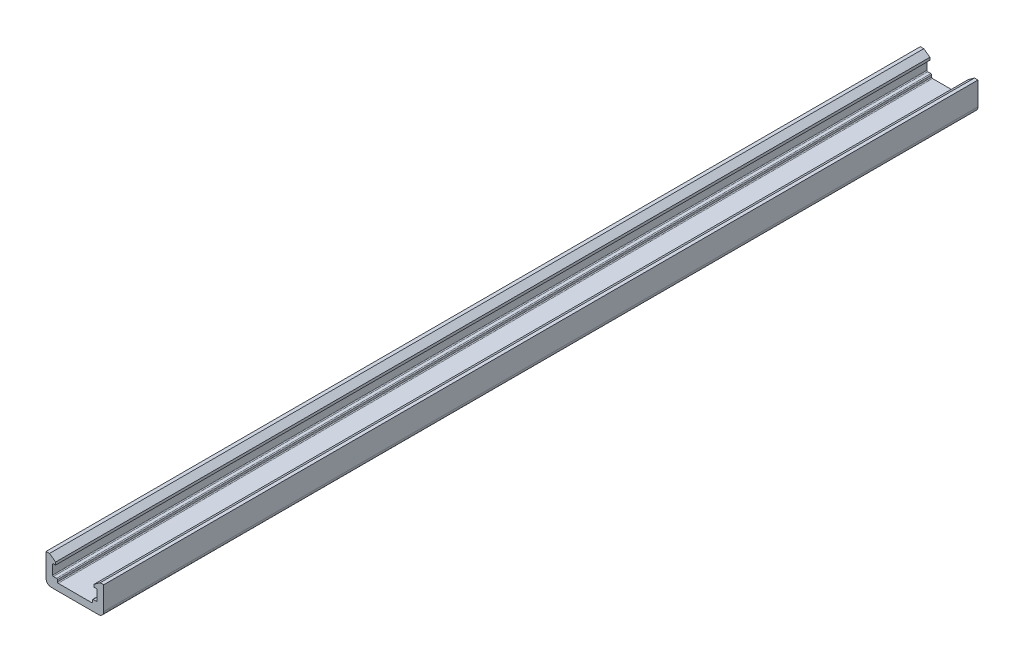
ISO-10303-21;
HEADER;
FILE_DESCRIPTION(('STEP AP214'),'2;1');
FILE_NAME('part.step','',(''),(''),'','','');
FILE_SCHEMA(('AUTOMOTIVE_DESIGN { 1 0 10303 214 1 1 1 1 }'));
ENDSEC;
DATA;
#1=APPLICATION_CONTEXT('core data for automotive mechanical design processes');
#2=APPLICATION_PROTOCOL_DEFINITION('international standard','automotive_design',2000,#1);
#3=PRODUCT_CONTEXT('',#1,'mechanical');
#4=PRODUCT('Part','Part','',(#3));
#5=PRODUCT_RELATED_PRODUCT_CATEGORY('part','',(#4));
#6=PRODUCT_DEFINITION_FORMATION('','',#4);
#7=PRODUCT_DEFINITION_CONTEXT('part definition',#1,'design');
#8=PRODUCT_DEFINITION('design','',#6,#7);
#9=PRODUCT_DEFINITION_SHAPE('','',#8);
#10=(LENGTH_UNIT() NAMED_UNIT(*) SI_UNIT(.MILLI.,.METRE.));
#11=(NAMED_UNIT(*) PLANE_ANGLE_UNIT() SI_UNIT($,.RADIAN.));
#12=(NAMED_UNIT(*) SI_UNIT($,.STERADIAN.) SOLID_ANGLE_UNIT());
#13=UNCERTAINTY_MEASURE_WITH_UNIT(LENGTH_MEASURE(1.E-05),#10,'distance_accuracy_value','');
#14=(GEOMETRIC_REPRESENTATION_CONTEXT(3) GLOBAL_UNCERTAINTY_ASSIGNED_CONTEXT((#13)) GLOBAL_UNIT_ASSIGNED_CONTEXT((#10,
#11,#12)) REPRESENTATION_CONTEXT('',''));
#15=CARTESIAN_POINT('',(0.,0.,0.));
#16=DIRECTION('',(0.,0.,1.));
#17=DIRECTION('',(1.,0.,0.));
#18=AXIS2_PLACEMENT_3D('',#15,#16,#17);
#19=CARTESIAN_POINT('',(13.5,3.00000000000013,500.));
#20=DIRECTION('',(0.,0.,-1.));
#21=DIRECTION('',(-1.,0.,0.));
#22=AXIS2_PLACEMENT_3D('',#19,#20,#21);
#23=CYLINDRICAL_SURFACE('',#22,3.);
#24=CARTESIAN_POINT('',(13.5,3.00000000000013,0.));
#25=DIRECTION('',(0.,0.,1.));
#26=DIRECTION('',(1.,0.,0.));
#27=AXIS2_PLACEMENT_3D('',#24,#25,#26);
#28=CIRCLE('',#27,3.);
#29=CARTESIAN_POINT('',(13.5,1.2490009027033E-13,0.));
#30=VERTEX_POINT('',#29);
#31=CARTESIAN_POINT('',(16.5,3.00000000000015,0.));
#32=VERTEX_POINT('',#31);
#33=EDGE_CURVE('E202',#30,#32,#28,.T.);
#34=ORIENTED_EDGE('',*,*,#33,.T.);
#35=DIRECTION('',(0.,0.,-1.));
#36=VECTOR('',#35,1.);
#37=CARTESIAN_POINT('',(16.5,3.00000000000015,500.));
#38=LINE('',#37,#36);
#39=CARTESIAN_POINT('',(16.5,3.00000000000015,500.));
#40=VERTEX_POINT('',#39);
#41=EDGE_CURVE('E9',#40,#32,#38,.T.);
#42=ORIENTED_EDGE('',*,*,#41,.F.);
#43=CARTESIAN_POINT('',(13.5,3.00000000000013,500.));
#44=DIRECTION('',(0.,0.,1.));
#45=DIRECTION('',(1.,0.,0.));
#46=AXIS2_PLACEMENT_3D('',#43,#44,#45);
#47=CIRCLE('',#46,3.);
#48=CARTESIAN_POINT('',(13.5,1.2490009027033E-13,500.));
#49=VERTEX_POINT('',#48);
#50=EDGE_CURVE('E269',#49,#40,#47,.T.);
#51=ORIENTED_EDGE('',*,*,#50,.F.);
#52=DIRECTION('',(0.,0.,-1.));
#53=VECTOR('',#52,1.);
#54=CARTESIAN_POINT('',(13.5,1.2490009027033E-13,500.));
#55=LINE('',#54,#53);
#56=EDGE_CURVE('E215',#49,#30,#55,.T.);
#57=ORIENTED_EDGE('',*,*,#56,.T.);
#58=EDGE_LOOP('',(#34,#42,#51,#57));
#59=FACE_BOUND('',#58,.T.);
#60=ADVANCED_FACE('F14',(#59),#23,.T.);
#61=CARTESIAN_POINT('',(16.5,16.3,500.));
#62=DIRECTION('',(-1.,0.,0.));
#63=DIRECTION('',(0.,-1.,0.));
#64=AXIS2_PLACEMENT_3D('',#61,#62,#63);
#65=PLANE('',#64);
#66=DIRECTION('',(0.,1.,0.));
#67=VECTOR('',#66,1.);
#68=CARTESIAN_POINT('',(16.5,16.3,0.));
#69=LINE('',#68,#67);
#70=CARTESIAN_POINT('',(16.5,16.3,0.));
#71=VERTEX_POINT('',#70);
#72=EDGE_CURVE('E198',#32,#71,#69,.T.);
#73=ORIENTED_EDGE('',*,*,#72,.T.);
#74=DIRECTION('',(0.,0.,-1.));
#75=VECTOR('',#74,1.);
#76=CARTESIAN_POINT('',(16.5,16.3,500.));
#77=LINE('',#76,#75);
#78=CARTESIAN_POINT('',(16.5,16.3,500.));
#79=VERTEX_POINT('',#78);
#80=EDGE_CURVE('E21',#79,#71,#77,.T.);
#81=ORIENTED_EDGE('',*,*,#80,.F.);
#82=DIRECTION('',(0.,1.,0.));
#83=VECTOR('',#82,1.);
#84=CARTESIAN_POINT('',(16.5,16.3,500.));
#85=LINE('',#84,#83);
#86=EDGE_CURVE('E211',#40,#79,#85,.T.);
#87=ORIENTED_EDGE('',*,*,#86,.F.);
#88=ORIENTED_EDGE('',*,*,#41,.T.);
#89=EDGE_LOOP('',(#73,#81,#87,#88));
#90=FACE_BOUND('',#89,.T.);
#91=ADVANCED_FACE('F210',(#90),#65,.F.);
#92=CARTESIAN_POINT('',(16.5,16.3,500.));
#93=DIRECTION('',(0.,-1.,0.));
#94=DIRECTION('',(0.,0.,-1.));
#95=AXIS2_PLACEMENT_3D('',#92,#93,#94);
#96=PLANE('',#95);
#97=DIRECTION('',(-1.,0.,0.));
#98=VECTOR('',#97,1.);
#99=CARTESIAN_POINT('',(16.5,16.3,0.));
#100=LINE('',#99,#98);
#101=CARTESIAN_POINT('',(14.4999999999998,16.3,0.));
#102=VERTEX_POINT('',#101);
#103=EDGE_CURVE('E204',#71,#102,#100,.T.);
#104=ORIENTED_EDGE('',*,*,#103,.T.);
#105=DIRECTION('',(0.,0.,-1.));
#106=VECTOR('',#105,1.);
#107=CARTESIAN_POINT('',(14.4999999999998,16.3,500.));
#108=LINE('',#107,#106);
#109=CARTESIAN_POINT('',(14.4999999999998,16.3,500.));
#110=VERTEX_POINT('',#109);
#111=EDGE_CURVE('E395',#110,#102,#108,.T.);
#112=ORIENTED_EDGE('',*,*,#111,.F.);
#113=DIRECTION('',(-1.,0.,0.));
#114=VECTOR('',#113,1.);
#115=CARTESIAN_POINT('',(16.5,16.3,500.));
#116=LINE('',#115,#114);
#117=EDGE_CURVE('E272',#79,#110,#116,.T.);
#118=ORIENTED_EDGE('',*,*,#117,.F.);
#119=ORIENTED_EDGE('',*,*,#80,.T.);
#120=EDGE_LOOP('',(#104,#112,#118,#119));
#121=FACE_BOUND('',#120,.T.);
#122=ADVANCED_FACE('F399',(#121),#96,.F.);
#123=CARTESIAN_POINT('',(14.4999999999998,16.3,500.));
#124=DIRECTION('',(0.581238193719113,-0.813733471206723,0.));
#125=DIRECTION('',(0.813733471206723,0.581238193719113,0.));
#126=AXIS2_PLACEMENT_3D('',#123,#124,#125);
#127=PLANE('',#126);
#128=DIRECTION('',(-0.813733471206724,-0.581238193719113,0.));
#129=VECTOR('',#128,1.);
#130=CARTESIAN_POINT('',(14.4999999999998,16.3,0.));
#131=LINE('',#130,#129);
#132=CARTESIAN_POINT('',(11.,13.8,0.));
#133=VERTEX_POINT('',#132);
#134=EDGE_CURVE('E219',#102,#133,#131,.T.);
#135=ORIENTED_EDGE('',*,*,#134,.T.);
#136=DIRECTION('',(0.,0.,-1.));
#137=VECTOR('',#136,1.);
#138=CARTESIAN_POINT('',(11.,13.8,500.));
#139=LINE('',#138,#137);
#140=CARTESIAN_POINT('',(11.,13.8,500.));
#141=VERTEX_POINT('',#140);
#142=EDGE_CURVE('E392',#141,#133,#139,.T.);
#143=ORIENTED_EDGE('',*,*,#142,.F.);
#144=DIRECTION('',(-0.813733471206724,-0.581238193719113,0.));
#145=VECTOR('',#144,1.);
#146=CARTESIAN_POINT('',(14.4999999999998,16.3,500.));
#147=LINE('',#146,#145);
#148=EDGE_CURVE('E274',#110,#141,#147,.T.);
#149=ORIENTED_EDGE('',*,*,#148,.F.);
#150=ORIENTED_EDGE('',*,*,#111,.T.);
#151=EDGE_LOOP('',(#135,#143,#149,#150));
#152=FACE_BOUND('',#151,.T.);
#153=ADVANCED_FACE('F407',(#152),#127,.F.);
#154=CARTESIAN_POINT('',(11.,13.8,500.));
#155=DIRECTION('',(1.,0.,0.));
#156=DIRECTION('',(0.,1.,0.));
#157=AXIS2_PLACEMENT_3D('',#154,#155,#156);
#158=PLANE('',#157);
#159=DIRECTION('',(0.,-1.,0.));
#160=VECTOR('',#159,1.);
#161=CARTESIAN_POINT('',(11.,13.8,0.));
#162=LINE('',#161,#160);
#163=CARTESIAN_POINT('',(11.,12.3000000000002,0.));
#164=VERTEX_POINT('',#163);
#165=EDGE_CURVE('E221',#133,#164,#162,.T.);
#166=ORIENTED_EDGE('',*,*,#165,.T.);
#167=DIRECTION('',(0.,0.,-1.));
#168=VECTOR('',#167,1.);
#169=CARTESIAN_POINT('',(11.,12.3000000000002,500.));
#170=LINE('',#169,#168);
#171=CARTESIAN_POINT('',(11.,12.3000000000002,500.));
#172=VERTEX_POINT('',#171);
#173=EDGE_CURVE('E389',#172,#164,#170,.T.);
#174=ORIENTED_EDGE('',*,*,#173,.F.);
#175=DIRECTION('',(0.,-1.,0.));
#176=VECTOR('',#175,1.);
#177=CARTESIAN_POINT('',(11.,13.8,500.));
#178=LINE('',#177,#176);
#179=EDGE_CURVE('E276',#141,#172,#178,.T.);
#180=ORIENTED_EDGE('',*,*,#179,.F.);
#181=ORIENTED_EDGE('',*,*,#142,.T.);
#182=EDGE_LOOP('',(#166,#174,#180,#181));
#183=FACE_BOUND('',#182,.T.);
#184=ADVANCED_FACE('F410',(#183),#158,.F.);
#185=CARTESIAN_POINT('',(12.25,12.3000000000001,500.));
#186=DIRECTION('',(0.,1.,0.));
#187=DIRECTION('',(-1.,0.,0.));
#188=AXIS2_PLACEMENT_3D('',#185,#186,#187);
#189=PLANE('',#188);
#190=DIRECTION('',(1.,0.,0.));
#191=VECTOR('',#190,1.);
#192=CARTESIAN_POINT('',(12.25,12.3000000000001,0.));
#193=LINE('',#192,#191);
#194=CARTESIAN_POINT('',(12.25,12.3000000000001,0.));
#195=VERTEX_POINT('',#194);
#196=EDGE_CURVE('E223',#164,#195,#193,.T.);
#197=ORIENTED_EDGE('',*,*,#196,.T.);
#198=DIRECTION('',(0.,0.,-1.));
#199=VECTOR('',#198,1.);
#200=CARTESIAN_POINT('',(12.25,12.3000000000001,500.));
#201=LINE('',#200,#199);
#202=CARTESIAN_POINT('',(12.25,12.3000000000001,500.));
#203=VERTEX_POINT('',#202);
#204=EDGE_CURVE('E386',#203,#195,#201,.T.);
#205=ORIENTED_EDGE('',*,*,#204,.F.);
#206=DIRECTION('',(1.,0.,0.));
#207=VECTOR('',#206,1.);
#208=CARTESIAN_POINT('',(12.25,12.3000000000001,500.));
#209=LINE('',#208,#207);
#210=EDGE_CURVE('E278',#172,#203,#209,.T.);
#211=ORIENTED_EDGE('',*,*,#210,.F.);
#212=ORIENTED_EDGE('',*,*,#173,.T.);
#213=EDGE_LOOP('',(#197,#205,#211,#212));
#214=FACE_BOUND('',#213,.T.);
#215=ADVANCED_FACE('F415',(#214),#189,.F.);
#216=CARTESIAN_POINT('',(12.25,11.8000000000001,500.));
#217=DIRECTION('',(0.,0.,-1.));
#218=DIRECTION('',(-1.,0.,0.));
#219=AXIS2_PLACEMENT_3D('',#216,#217,#218);
#220=CYLINDRICAL_SURFACE('',#219,0.5);
#221=CARTESIAN_POINT('',(12.25,11.8000000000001,0.));
#222=DIRECTION('',(0.,0.,-1.));
#223=DIRECTION('',(1.,0.,0.));
#224=AXIS2_PLACEMENT_3D('',#221,#222,#223);
#225=CIRCLE('',#224,0.5);
#226=CARTESIAN_POINT('',(12.75,11.8000000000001,0.));
#227=VERTEX_POINT('',#226);
#228=EDGE_CURVE('E225',#195,#227,#225,.T.);
#229=ORIENTED_EDGE('',*,*,#228,.T.);
#230=DIRECTION('',(0.,0.,-1.));
#231=VECTOR('',#230,1.);
#232=CARTESIAN_POINT('',(12.75,11.8000000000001,500.));
#233=LINE('',#232,#231);
#234=CARTESIAN_POINT('',(12.75,11.8000000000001,500.));
#235=VERTEX_POINT('',#234);
#236=EDGE_CURVE('E383',#235,#227,#233,.T.);
#237=ORIENTED_EDGE('',*,*,#236,.F.);
#238=CARTESIAN_POINT('',(12.25,11.8000000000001,500.));
#239=DIRECTION('',(0.,0.,-1.));
#240=DIRECTION('',(1.,0.,0.));
#241=AXIS2_PLACEMENT_3D('',#238,#239,#240);
#242=CIRCLE('',#241,0.5);
#243=EDGE_CURVE('E280',#203,#235,#242,.T.);
#244=ORIENTED_EDGE('',*,*,#243,.F.);
#245=ORIENTED_EDGE('',*,*,#204,.T.);
#246=EDGE_LOOP('',(#229,#237,#244,#245));
#247=FACE_BOUND('',#246,.T.);
#248=ADVANCED_FACE('F421',(#247),#220,.F.);
#249=CARTESIAN_POINT('',(12.75,11.8000000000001,500.));
#250=DIRECTION('',(1.,0.,0.));
#251=DIRECTION('',(0.,1.,0.));
#252=AXIS2_PLACEMENT_3D('',#249,#250,#251);
#253=PLANE('',#252);
#254=DIRECTION('',(0.,-1.,0.));
#255=VECTOR('',#254,1.);
#256=CARTESIAN_POINT('',(12.75,11.8000000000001,0.));
#257=LINE('',#256,#255);
#258=CARTESIAN_POINT('',(12.75,6.50000000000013,0.));
#259=VERTEX_POINT('',#258);
#260=EDGE_CURVE('E227',#227,#259,#257,.T.);
#261=ORIENTED_EDGE('',*,*,#260,.T.);
#262=DIRECTION('',(0.,0.,-1.));
#263=VECTOR('',#262,1.);
#264=CARTESIAN_POINT('',(12.75,6.50000000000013,500.));
#265=LINE('',#264,#263);
#266=CARTESIAN_POINT('',(12.75,6.50000000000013,500.));
#267=VERTEX_POINT('',#266);
#268=EDGE_CURVE('E380',#267,#259,#265,.T.);
#269=ORIENTED_EDGE('',*,*,#268,.F.);
#270=DIRECTION('',(0.,-1.,0.));
#271=VECTOR('',#270,1.);
#272=CARTESIAN_POINT('',(12.75,11.8000000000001,500.));
#273=LINE('',#272,#271);
#274=EDGE_CURVE('E282',#235,#267,#273,.T.);
#275=ORIENTED_EDGE('',*,*,#274,.F.);
#276=ORIENTED_EDGE('',*,*,#236,.T.);
#277=EDGE_LOOP('',(#261,#269,#275,#276));
#278=FACE_BOUND('',#277,.T.);
#279=ADVANCED_FACE('F425',(#278),#253,.F.);
#280=CARTESIAN_POINT('',(12.25,6.50000000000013,500.));
#281=DIRECTION('',(0.,0.,-1.));
#282=DIRECTION('',(-1.,0.,0.));
#283=AXIS2_PLACEMENT_3D('',#280,#281,#282);
#284=CYLINDRICAL_SURFACE('',#283,0.5);
#285=CARTESIAN_POINT('',(12.25,6.50000000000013,0.));
#286=DIRECTION('',(0.,0.,-1.));
#287=DIRECTION('',(1.,0.,0.));
#288=AXIS2_PLACEMENT_3D('',#285,#286,#287);
#289=CIRCLE('',#288,0.5);
#290=CARTESIAN_POINT('',(12.25,6.00000000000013,0.));
#291=VERTEX_POINT('',#290);
#292=EDGE_CURVE('E229',#259,#291,#289,.T.);
#293=ORIENTED_EDGE('',*,*,#292,.T.);
#294=DIRECTION('',(0.,0.,-1.));
#295=VECTOR('',#294,1.);
#296=CARTESIAN_POINT('',(12.25,6.00000000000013,500.));
#297=LINE('',#296,#295);
#298=CARTESIAN_POINT('',(12.25,6.00000000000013,500.));
#299=VERTEX_POINT('',#298);
#300=EDGE_CURVE('E377',#299,#291,#297,.T.);
#301=ORIENTED_EDGE('',*,*,#300,.F.);
#302=CARTESIAN_POINT('',(12.25,6.50000000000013,500.));
#303=DIRECTION('',(0.,0.,-1.));
#304=DIRECTION('',(1.,0.,0.));
#305=AXIS2_PLACEMENT_3D('',#302,#303,#304);
#306=CIRCLE('',#305,0.5);
#307=EDGE_CURVE('E284',#267,#299,#306,.T.);
#308=ORIENTED_EDGE('',*,*,#307,.F.);
#309=ORIENTED_EDGE('',*,*,#268,.T.);
#310=EDGE_LOOP('',(#293,#301,#308,#309));
#311=FACE_BOUND('',#310,.T.);
#312=ADVANCED_FACE('F430',(#311),#284,.F.);
#313=CARTESIAN_POINT('',(12.25,6.00000000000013,500.));
#314=DIRECTION('',(0.,-1.,0.));
#315=DIRECTION('',(0.,0.,-1.));
#316=AXIS2_PLACEMENT_3D('',#313,#314,#315);
#317=PLANE('',#316);
#318=DIRECTION('',(-1.,0.,0.));
#319=VECTOR('',#318,1.);
#320=CARTESIAN_POINT('',(12.25,6.00000000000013,0.));
#321=LINE('',#320,#319);
#322=CARTESIAN_POINT('',(10.5,6.00000000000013,0.));
#323=VERTEX_POINT('',#322);
#324=EDGE_CURVE('E231',#291,#323,#321,.T.);
#325=ORIENTED_EDGE('',*,*,#324,.T.);
#326=DIRECTION('',(0.,0.,-1.));
#327=VECTOR('',#326,1.);
#328=CARTESIAN_POINT('',(10.5,6.00000000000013,500.));
#329=LINE('',#328,#327);
#330=CARTESIAN_POINT('',(10.5,6.00000000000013,500.));
#331=VERTEX_POINT('',#330);
#332=EDGE_CURVE('E374',#331,#323,#329,.T.);
#333=ORIENTED_EDGE('',*,*,#332,.F.);
#334=DIRECTION('',(-1.,0.,0.));
#335=VECTOR('',#334,1.);
#336=CARTESIAN_POINT('',(12.25,6.00000000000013,500.));
#337=LINE('',#336,#335);
#338=EDGE_CURVE('E286',#299,#331,#337,.T.);
#339=ORIENTED_EDGE('',*,*,#338,.F.);
#340=ORIENTED_EDGE('',*,*,#300,.T.);
#341=EDGE_LOOP('',(#325,#333,#339,#340));
#342=FACE_BOUND('',#341,.T.);
#343=ADVANCED_FACE('F436',(#342),#317,.F.);
#344=CARTESIAN_POINT('',(10.5,5.50000000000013,500.));
#345=DIRECTION('',(0.,0.,-1.));
#346=DIRECTION('',(-1.,0.,0.));
#347=AXIS2_PLACEMENT_3D('',#344,#345,#346);
#348=CYLINDRICAL_SURFACE('',#347,0.5);
#349=CARTESIAN_POINT('',(10.5,5.50000000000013,0.));
#350=DIRECTION('',(0.,0.,1.));
#351=DIRECTION('',(1.,0.,0.));
#352=AXIS2_PLACEMENT_3D('',#349,#350,#351);
#353=CIRCLE('',#352,0.5);
#354=CARTESIAN_POINT('',(10.,5.5000000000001,0.));
#355=VERTEX_POINT('',#354);
#356=EDGE_CURVE('E233',#323,#355,#353,.T.);
#357=ORIENTED_EDGE('',*,*,#356,.T.);
#358=DIRECTION('',(0.,0.,-1.));
#359=VECTOR('',#358,1.);
#360=CARTESIAN_POINT('',(10.,5.5000000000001,500.));
#361=LINE('',#360,#359);
#362=CARTESIAN_POINT('',(10.,5.5000000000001,500.));
#363=VERTEX_POINT('',#362);
#364=EDGE_CURVE('E371',#363,#355,#361,.T.);
#365=ORIENTED_EDGE('',*,*,#364,.F.);
#366=CARTESIAN_POINT('',(10.5,5.50000000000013,500.));
#367=DIRECTION('',(0.,0.,1.));
#368=DIRECTION('',(1.,0.,0.));
#369=AXIS2_PLACEMENT_3D('',#366,#367,#368);
#370=CIRCLE('',#369,0.5);
#371=EDGE_CURVE('E288',#331,#363,#370,.T.);
#372=ORIENTED_EDGE('',*,*,#371,.F.);
#373=ORIENTED_EDGE('',*,*,#332,.T.);
#374=EDGE_LOOP('',(#357,#365,#372,#373));
#375=FACE_BOUND('',#374,.T.);
#376=ADVANCED_FACE('F440',(#375),#348,.T.);
#377=CARTESIAN_POINT('',(10.,5.5000000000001,500.));
#378=DIRECTION('',(1.,0.,0.));
#379=DIRECTION('',(0.,1.,0.));
#380=AXIS2_PLACEMENT_3D('',#377,#378,#379);
#381=PLANE('',#380);
#382=DIRECTION('',(0.,-1.,0.));
#383=VECTOR('',#382,1.);
#384=CARTESIAN_POINT('',(10.,5.5000000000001,0.));
#385=LINE('',#384,#383);
#386=CARTESIAN_POINT('',(10.,4.50000000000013,0.));
#387=VERTEX_POINT('',#386);
#388=EDGE_CURVE('E235',#355,#387,#385,.T.);
#389=ORIENTED_EDGE('',*,*,#388,.T.);
#390=DIRECTION('',(0.,0.,-1.));
#391=VECTOR('',#390,1.);
#392=CARTESIAN_POINT('',(10.,4.50000000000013,500.));
#393=LINE('',#392,#391);
#394=CARTESIAN_POINT('',(10.,4.50000000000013,500.));
#395=VERTEX_POINT('',#394);
#396=EDGE_CURVE('E368',#395,#387,#393,.T.);
#397=ORIENTED_EDGE('',*,*,#396,.F.);
#398=DIRECTION('',(0.,-1.,0.));
#399=VECTOR('',#398,1.);
#400=CARTESIAN_POINT('',(10.,5.5000000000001,500.));
#401=LINE('',#400,#399);
#402=EDGE_CURVE('E290',#363,#395,#401,.T.);
#403=ORIENTED_EDGE('',*,*,#402,.F.);
#404=ORIENTED_EDGE('',*,*,#364,.T.);
#405=EDGE_LOOP('',(#389,#397,#403,#404));
#406=FACE_BOUND('',#405,.T.);
#407=ADVANCED_FACE('F445',(#406),#381,.F.);
#408=CARTESIAN_POINT('',(9.5,4.50000000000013,500.));
#409=DIRECTION('',(0.,0.,-1.));
#410=DIRECTION('',(-1.,0.,0.));
#411=AXIS2_PLACEMENT_3D('',#408,#409,#410);
#412=CYLINDRICAL_SURFACE('',#411,0.5);
#413=CARTESIAN_POINT('',(9.5,4.50000000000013,0.));
#414=DIRECTION('',(0.,0.,-1.));
#415=DIRECTION('',(1.,0.,0.));
#416=AXIS2_PLACEMENT_3D('',#413,#414,#415);
#417=CIRCLE('',#416,0.5);
#418=CARTESIAN_POINT('',(9.5,4.00000000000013,0.));
#419=VERTEX_POINT('',#418);
#420=EDGE_CURVE('E237',#387,#419,#417,.T.);
#421=ORIENTED_EDGE('',*,*,#420,.T.);
#422=DIRECTION('',(0.,0.,-1.));
#423=VECTOR('',#422,1.);
#424=CARTESIAN_POINT('',(9.5,4.00000000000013,500.));
#425=LINE('',#424,#423);
#426=CARTESIAN_POINT('',(9.5,4.00000000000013,500.));
#427=VERTEX_POINT('',#426);
#428=EDGE_CURVE('E365',#427,#419,#425,.T.);
#429=ORIENTED_EDGE('',*,*,#428,.F.);
#430=CARTESIAN_POINT('',(9.5,4.50000000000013,500.));
#431=DIRECTION('',(0.,0.,-1.));
#432=DIRECTION('',(1.,0.,0.));
#433=AXIS2_PLACEMENT_3D('',#430,#431,#432);
#434=CIRCLE('',#433,0.5);
#435=EDGE_CURVE('E292',#395,#427,#434,.T.);
#436=ORIENTED_EDGE('',*,*,#435,.F.);
#437=ORIENTED_EDGE('',*,*,#396,.T.);
#438=EDGE_LOOP('',(#421,#429,#436,#437));
#439=FACE_BOUND('',#438,.T.);
#440=ADVANCED_FACE('F451',(#439),#412,.F.);
#441=CARTESIAN_POINT('',(9.5,4.00000000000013,500.));
#442=DIRECTION('',(0.,-1.,0.));
#443=DIRECTION('',(1.,0.,0.));
#444=AXIS2_PLACEMENT_3D('',#441,#442,#443);
#445=PLANE('',#444);
#446=DIRECTION('',(-1.,0.,0.));
#447=VECTOR('',#446,1.);
#448=CARTESIAN_POINT('',(9.5,4.00000000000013,0.));
#449=LINE('',#448,#447);
#450=CARTESIAN_POINT('',(-9.5,3.99999999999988,0.));
#451=VERTEX_POINT('',#450);
#452=EDGE_CURVE('E239',#419,#451,#449,.T.);
#453=ORIENTED_EDGE('',*,*,#452,.T.);
#454=DIRECTION('',(0.,0.,-1.));
#455=VECTOR('',#454,1.);
#456=CARTESIAN_POINT('',(-9.5,3.99999999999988,500.));
#457=LINE('',#456,#455);
#458=CARTESIAN_POINT('',(-9.5,3.99999999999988,500.));
#459=VERTEX_POINT('',#458);
#460=EDGE_CURVE('E362',#459,#451,#457,.T.);
#461=ORIENTED_EDGE('',*,*,#460,.F.);
#462=DIRECTION('',(-1.,0.,0.));
#463=VECTOR('',#462,1.);
#464=CARTESIAN_POINT('',(9.5,4.00000000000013,500.));
#465=LINE('',#464,#463);
#466=EDGE_CURVE('E294',#427,#459,#465,.T.);
#467=ORIENTED_EDGE('',*,*,#466,.F.);
#468=ORIENTED_EDGE('',*,*,#428,.T.);
#469=EDGE_LOOP('',(#453,#461,#467,#468));
#470=FACE_BOUND('',#469,.T.);
#471=ADVANCED_FACE('F455',(#470),#445,.F.);
#472=CARTESIAN_POINT('',(-9.5,4.49999999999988,500.));
#473=DIRECTION('',(0.,0.,-1.));
#474=DIRECTION('',(-1.,0.,0.));
#475=AXIS2_PLACEMENT_3D('',#472,#473,#474);
#476=CYLINDRICAL_SURFACE('',#475,0.5);
#477=CARTESIAN_POINT('',(-9.5,4.49999999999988,0.));
#478=DIRECTION('',(0.,0.,-1.));
#479=DIRECTION('',(1.,0.,0.));
#480=AXIS2_PLACEMENT_3D('',#477,#478,#479);
#481=CIRCLE('',#480,0.5);
#482=CARTESIAN_POINT('',(-10.,4.49999999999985,0.));
#483=VERTEX_POINT('',#482);
#484=EDGE_CURVE('E241',#451,#483,#481,.T.);
#485=ORIENTED_EDGE('',*,*,#484,.T.);
#486=DIRECTION('',(0.,0.,-1.));
#487=VECTOR('',#486,1.);
#488=CARTESIAN_POINT('',(-10.,4.49999999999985,500.));
#489=LINE('',#488,#487);
#490=CARTESIAN_POINT('',(-10.,4.49999999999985,500.));
#491=VERTEX_POINT('',#490);
#492=EDGE_CURVE('E359',#491,#483,#489,.T.);
#493=ORIENTED_EDGE('',*,*,#492,.F.);
#494=CARTESIAN_POINT('',(-9.5,4.49999999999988,500.));
#495=DIRECTION('',(0.,0.,-1.));
#496=DIRECTION('',(1.,0.,0.));
#497=AXIS2_PLACEMENT_3D('',#494,#495,#496);
#498=CIRCLE('',#497,0.5);
#499=EDGE_CURVE('E296',#459,#491,#498,.T.);
#500=ORIENTED_EDGE('',*,*,#499,.F.);
#501=ORIENTED_EDGE('',*,*,#460,.T.);
#502=EDGE_LOOP('',(#485,#493,#500,#501));
#503=FACE_BOUND('',#502,.T.);
#504=ADVANCED_FACE('F460',(#503),#476,.F.);
#505=CARTESIAN_POINT('',(-10.,5.49999999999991,500.));
#506=DIRECTION('',(-1.,0.,0.));
#507=DIRECTION('',(0.,-1.,0.));
#508=AXIS2_PLACEMENT_3D('',#505,#506,#507);
#509=PLANE('',#508);
#510=DIRECTION('',(0.,1.,0.));
#511=VECTOR('',#510,1.);
#512=CARTESIAN_POINT('',(-10.,5.49999999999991,0.));
#513=LINE('',#512,#511);
#514=CARTESIAN_POINT('',(-10.,5.49999999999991,0.));
#515=VERTEX_POINT('',#514);
#516=EDGE_CURVE('E243',#483,#515,#513,.T.);
#517=ORIENTED_EDGE('',*,*,#516,.T.);
#518=DIRECTION('',(0.,0.,-1.));
#519=VECTOR('',#518,1.);
#520=CARTESIAN_POINT('',(-10.,5.49999999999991,500.));
#521=LINE('',#520,#519);
#522=CARTESIAN_POINT('',(-10.,5.49999999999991,500.));
#523=VERTEX_POINT('',#522);
#524=EDGE_CURVE('E356',#523,#515,#521,.T.);
#525=ORIENTED_EDGE('',*,*,#524,.F.);
#526=DIRECTION('',(0.,1.,0.));
#527=VECTOR('',#526,1.);
#528=CARTESIAN_POINT('',(-10.,5.49999999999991,500.));
#529=LINE('',#528,#527);
#530=EDGE_CURVE('E298',#491,#523,#529,.T.);
#531=ORIENTED_EDGE('',*,*,#530,.F.);
#532=ORIENTED_EDGE('',*,*,#492,.T.);
#533=EDGE_LOOP('',(#517,#525,#531,#532));
#534=FACE_BOUND('',#533,.T.);
#535=ADVANCED_FACE('F466',(#534),#509,.F.);
#536=CARTESIAN_POINT('',(-10.5,5.49999999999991,500.));
#537=DIRECTION('',(0.,0.,-1.));
#538=DIRECTION('',(-1.,0.,0.));
#539=AXIS2_PLACEMENT_3D('',#536,#537,#538);
#540=CYLINDRICAL_SURFACE('',#539,0.5);
#541=CARTESIAN_POINT('',(-10.5,5.49999999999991,0.));
#542=DIRECTION('',(0.,0.,1.));
#543=DIRECTION('',(1.,0.,0.));
#544=AXIS2_PLACEMENT_3D('',#541,#542,#543);
#545=CIRCLE('',#544,0.5);
#546=CARTESIAN_POINT('',(-10.5,5.99999999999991,0.));
#547=VERTEX_POINT('',#546);
#548=EDGE_CURVE('E245',#515,#547,#545,.T.);
#549=ORIENTED_EDGE('',*,*,#548,.T.);
#550=DIRECTION('',(0.,0.,-1.));
#551=VECTOR('',#550,1.);
#552=CARTESIAN_POINT('',(-10.5,5.99999999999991,500.));
#553=LINE('',#552,#551);
#554=CARTESIAN_POINT('',(-10.5,5.99999999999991,500.));
#555=VERTEX_POINT('',#554);
#556=EDGE_CURVE('E353',#555,#547,#553,.T.);
#557=ORIENTED_EDGE('',*,*,#556,.F.);
#558=CARTESIAN_POINT('',(-10.5,5.49999999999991,500.));
#559=DIRECTION('',(0.,0.,1.));
#560=DIRECTION('',(1.,0.,0.));
#561=AXIS2_PLACEMENT_3D('',#558,#559,#560);
#562=CIRCLE('',#561,0.5);
#563=EDGE_CURVE('E300',#523,#555,#562,.T.);
#564=ORIENTED_EDGE('',*,*,#563,.F.);
#565=ORIENTED_EDGE('',*,*,#524,.T.);
#566=EDGE_LOOP('',(#549,#557,#564,#565));
#567=FACE_BOUND('',#566,.T.);
#568=ADVANCED_FACE('F470',(#567),#540,.T.);
#569=CARTESIAN_POINT('',(-10.5,5.99999999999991,500.));
#570=DIRECTION('',(0.,-1.,0.));
#571=DIRECTION('',(0.,0.,-1.));
#572=AXIS2_PLACEMENT_3D('',#569,#570,#571);
#573=PLANE('',#572);
#574=DIRECTION('',(-1.,0.,0.));
#575=VECTOR('',#574,1.);
#576=CARTESIAN_POINT('',(-10.5,5.99999999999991,0.));
#577=LINE('',#576,#575);
#578=CARTESIAN_POINT('',(-12.25,5.99999999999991,0.));
#579=VERTEX_POINT('',#578);
#580=EDGE_CURVE('E247',#547,#579,#577,.T.);
#581=ORIENTED_EDGE('',*,*,#580,.T.);
#582=DIRECTION('',(0.,0.,-1.));
#583=VECTOR('',#582,1.);
#584=CARTESIAN_POINT('',(-12.25,5.99999999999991,500.));
#585=LINE('',#584,#583);
#586=CARTESIAN_POINT('',(-12.25,5.99999999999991,500.));
#587=VERTEX_POINT('',#586);
#588=EDGE_CURVE('E350',#587,#579,#585,.T.);
#589=ORIENTED_EDGE('',*,*,#588,.F.);
#590=DIRECTION('',(-1.,0.,0.));
#591=VECTOR('',#590,1.);
#592=CARTESIAN_POINT('',(-10.5,5.99999999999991,500.));
#593=LINE('',#592,#591);
#594=EDGE_CURVE('E302',#555,#587,#593,.T.);
#595=ORIENTED_EDGE('',*,*,#594,.F.);
#596=ORIENTED_EDGE('',*,*,#556,.T.);
#597=EDGE_LOOP('',(#581,#589,#595,#596));
#598=FACE_BOUND('',#597,.T.);
#599=ADVANCED_FACE('F475',(#598),#573,.F.);
#600=CARTESIAN_POINT('',(-12.25,6.49999999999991,500.));
#601=DIRECTION('',(0.,0.,-1.));
#602=DIRECTION('',(-1.,0.,0.));
#603=AXIS2_PLACEMENT_3D('',#600,#601,#602);
#604=CYLINDRICAL_SURFACE('',#603,0.5);
#605=CARTESIAN_POINT('',(-12.25,6.49999999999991,0.));
#606=DIRECTION('',(0.,0.,-1.));
#607=DIRECTION('',(1.,0.,0.));
#608=AXIS2_PLACEMENT_3D('',#605,#606,#607);
#609=CIRCLE('',#608,0.5);
#610=CARTESIAN_POINT('',(-12.75,6.49999999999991,0.));
#611=VERTEX_POINT('',#610);
#612=EDGE_CURVE('E249',#579,#611,#609,.T.);
#613=ORIENTED_EDGE('',*,*,#612,.T.);
#614=DIRECTION('',(0.,0.,-1.));
#615=VECTOR('',#614,1.);
#616=CARTESIAN_POINT('',(-12.75,6.49999999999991,500.));
#617=LINE('',#616,#615);
#618=CARTESIAN_POINT('',(-12.75,6.49999999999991,500.));
#619=VERTEX_POINT('',#618);
#620=EDGE_CURVE('E347',#619,#611,#617,.T.);
#621=ORIENTED_EDGE('',*,*,#620,.F.);
#622=CARTESIAN_POINT('',(-12.25,6.49999999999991,500.));
#623=DIRECTION('',(0.,0.,-1.));
#624=DIRECTION('',(1.,0.,0.));
#625=AXIS2_PLACEMENT_3D('',#622,#623,#624);
#626=CIRCLE('',#625,0.5);
#627=EDGE_CURVE('E304',#587,#619,#626,.T.);
#628=ORIENTED_EDGE('',*,*,#627,.F.);
#629=ORIENTED_EDGE('',*,*,#588,.T.);
#630=EDGE_LOOP('',(#613,#621,#628,#629));
#631=FACE_BOUND('',#630,.T.);
#632=ADVANCED_FACE('F481',(#631),#604,.F.);
#633=CARTESIAN_POINT('',(-12.75,11.7999999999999,500.));
#634=DIRECTION('',(-1.,0.,0.));
#635=DIRECTION('',(0.,-1.,0.));
#636=AXIS2_PLACEMENT_3D('',#633,#634,#635);
#637=PLANE('',#636);
#638=DIRECTION('',(0.,1.,0.));
#639=VECTOR('',#638,1.);
#640=CARTESIAN_POINT('',(-12.75,11.7999999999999,0.));
#641=LINE('',#640,#639);
#642=CARTESIAN_POINT('',(-12.75,11.7999999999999,0.));
#643=VERTEX_POINT('',#642);
#644=EDGE_CURVE('E251',#611,#643,#641,.T.);
#645=ORIENTED_EDGE('',*,*,#644,.T.);
#646=DIRECTION('',(0.,0.,-1.));
#647=VECTOR('',#646,1.);
#648=CARTESIAN_POINT('',(-12.75,11.7999999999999,500.));
#649=LINE('',#648,#647);
#650=CARTESIAN_POINT('',(-12.75,11.7999999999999,500.));
#651=VERTEX_POINT('',#650);
#652=EDGE_CURVE('E344',#651,#643,#649,.T.);
#653=ORIENTED_EDGE('',*,*,#652,.F.);
#654=DIRECTION('',(0.,1.,0.));
#655=VECTOR('',#654,1.);
#656=CARTESIAN_POINT('',(-12.75,11.7999999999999,500.));
#657=LINE('',#656,#655);
#658=EDGE_CURVE('E306',#619,#651,#657,.T.);
#659=ORIENTED_EDGE('',*,*,#658,.F.);
#660=ORIENTED_EDGE('',*,*,#620,.T.);
#661=EDGE_LOOP('',(#645,#653,#659,#660));
#662=FACE_BOUND('',#661,.T.);
#663=ADVANCED_FACE('F485',(#662),#637,.F.);
#664=CARTESIAN_POINT('',(-12.25,11.7999999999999,500.));
#665=DIRECTION('',(0.,0.,-1.));
#666=DIRECTION('',(-1.,0.,0.));
#667=AXIS2_PLACEMENT_3D('',#664,#665,#666);
#668=CYLINDRICAL_SURFACE('',#667,0.5);
#669=CARTESIAN_POINT('',(-12.25,11.7999999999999,0.));
#670=DIRECTION('',(0.,0.,-1.));
#671=DIRECTION('',(1.,0.,0.));
#672=AXIS2_PLACEMENT_3D('',#669,#670,#671);
#673=CIRCLE('',#672,0.5);
#674=CARTESIAN_POINT('',(-12.25,12.2999999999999,0.));
#675=VERTEX_POINT('',#674);
#676=EDGE_CURVE('E253',#643,#675,#673,.T.);
#677=ORIENTED_EDGE('',*,*,#676,.T.);
#678=DIRECTION('',(0.,0.,-1.));
#679=VECTOR('',#678,1.);
#680=CARTESIAN_POINT('',(-12.25,12.2999999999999,500.));
#681=LINE('',#680,#679);
#682=CARTESIAN_POINT('',(-12.25,12.2999999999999,500.));
#683=VERTEX_POINT('',#682);
#684=EDGE_CURVE('E341',#683,#675,#681,.T.);
#685=ORIENTED_EDGE('',*,*,#684,.F.);
#686=CARTESIAN_POINT('',(-12.25,11.7999999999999,500.));
#687=DIRECTION('',(0.,0.,-1.));
#688=DIRECTION('',(1.,0.,0.));
#689=AXIS2_PLACEMENT_3D('',#686,#687,#688);
#690=CIRCLE('',#689,0.5);
#691=EDGE_CURVE('E308',#651,#683,#690,.T.);
#692=ORIENTED_EDGE('',*,*,#691,.F.);
#693=ORIENTED_EDGE('',*,*,#652,.T.);
#694=EDGE_LOOP('',(#677,#685,#692,#693));
#695=FACE_BOUND('',#694,.T.);
#696=ADVANCED_FACE('F490',(#695),#668,.F.);
#697=CARTESIAN_POINT('',(-11.,12.3,500.));
#698=DIRECTION('',(0.,1.,0.));
#699=DIRECTION('',(-1.,0.,0.));
#700=AXIS2_PLACEMENT_3D('',#697,#698,#699);
#701=PLANE('',#700);
#702=DIRECTION('',(1.,0.,0.));
#703=VECTOR('',#702,1.);
#704=CARTESIAN_POINT('',(-11.,12.3,0.));
#705=LINE('',#704,#703);
#706=CARTESIAN_POINT('',(-11.,12.3,0.));
#707=VERTEX_POINT('',#706);
#708=EDGE_CURVE('E255',#675,#707,#705,.T.);
#709=ORIENTED_EDGE('',*,*,#708,.T.);
#710=DIRECTION('',(0.,0.,-1.));
#711=VECTOR('',#710,1.);
#712=CARTESIAN_POINT('',(-11.,12.3,500.));
#713=LINE('',#712,#711);
#714=CARTESIAN_POINT('',(-11.,12.3,500.));
#715=VERTEX_POINT('',#714);
#716=EDGE_CURVE('E338',#715,#707,#713,.T.);
#717=ORIENTED_EDGE('',*,*,#716,.F.);
#718=DIRECTION('',(1.,0.,0.));
#719=VECTOR('',#718,1.);
#720=CARTESIAN_POINT('',(-11.,12.3,500.));
#721=LINE('',#720,#719);
#722=EDGE_CURVE('E310',#683,#715,#721,.T.);
#723=ORIENTED_EDGE('',*,*,#722,.F.);
#724=ORIENTED_EDGE('',*,*,#684,.T.);
#725=EDGE_LOOP('',(#709,#717,#723,#724));
#726=FACE_BOUND('',#725,.T.);
#727=ADVANCED_FACE('F496',(#726),#701,.F.);
#728=CARTESIAN_POINT('',(-11.,13.7999999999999,500.));
#729=DIRECTION('',(-1.,0.,0.));
#730=DIRECTION('',(0.,-1.,0.));
#731=AXIS2_PLACEMENT_3D('',#728,#729,#730);
#732=PLANE('',#731);
#733=DIRECTION('',(0.,1.,0.));
#734=VECTOR('',#733,1.);
#735=CARTESIAN_POINT('',(-11.,13.7999999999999,0.));
#736=LINE('',#735,#734);
#737=CARTESIAN_POINT('',(-11.,13.7999999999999,0.));
#738=VERTEX_POINT('',#737);
#739=EDGE_CURVE('E257',#707,#738,#736,.T.);
#740=ORIENTED_EDGE('',*,*,#739,.T.);
#741=DIRECTION('',(0.,0.,-1.));
#742=VECTOR('',#741,1.);
#743=CARTESIAN_POINT('',(-11.,13.7999999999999,500.));
#744=LINE('',#743,#742);
#745=CARTESIAN_POINT('',(-11.,13.7999999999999,500.));
#746=VERTEX_POINT('',#745);
#747=EDGE_CURVE('E335',#746,#738,#744,.T.);
#748=ORIENTED_EDGE('',*,*,#747,.F.);
#749=DIRECTION('',(0.,1.,0.));
#750=VECTOR('',#749,1.);
#751=CARTESIAN_POINT('',(-11.,13.7999999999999,500.));
#752=LINE('',#751,#750);
#753=EDGE_CURVE('E312',#715,#746,#752,.T.);
#754=ORIENTED_EDGE('',*,*,#753,.F.);
#755=ORIENTED_EDGE('',*,*,#716,.T.);
#756=EDGE_LOOP('',(#740,#748,#754,#755));
#757=FACE_BOUND('',#756,.T.);
#758=ADVANCED_FACE('F500',(#757),#732,.F.);
#759=CARTESIAN_POINT('',(-14.5000000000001,16.3,500.));
#760=DIRECTION('',(-0.581238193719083,-0.813733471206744,0.));
#761=DIRECTION('',(0.813733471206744,-0.581238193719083,0.));
#762=AXIS2_PLACEMENT_3D('',#759,#760,#761);
#763=PLANE('',#762);
#764=DIRECTION('',(-0.813733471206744,0.581238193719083,0.));
#765=VECTOR('',#764,1.);
#766=CARTESIAN_POINT('',(-14.5000000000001,16.3,0.));
#767=LINE('',#766,#765);
#768=CARTESIAN_POINT('',(-14.5000000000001,16.3,0.));
#769=VERTEX_POINT('',#768);
#770=EDGE_CURVE('E259',#738,#769,#767,.T.);
#771=ORIENTED_EDGE('',*,*,#770,.T.);
#772=DIRECTION('',(0.,0.,-1.));
#773=VECTOR('',#772,1.);
#774=CARTESIAN_POINT('',(-14.5000000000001,16.3,500.));
#775=LINE('',#774,#773);
#776=CARTESIAN_POINT('',(-14.5000000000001,16.3,500.));
#777=VERTEX_POINT('',#776);
#778=EDGE_CURVE('E332',#777,#769,#775,.T.);
#779=ORIENTED_EDGE('',*,*,#778,.F.);
#780=DIRECTION('',(-0.813733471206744,0.581238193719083,0.));
#781=VECTOR('',#780,1.);
#782=CARTESIAN_POINT('',(-14.5000000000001,16.3,500.));
#783=LINE('',#782,#781);
#784=EDGE_CURVE('E314',#746,#777,#783,.T.);
#785=ORIENTED_EDGE('',*,*,#784,.F.);
#786=ORIENTED_EDGE('',*,*,#747,.T.);
#787=EDGE_LOOP('',(#771,#779,#785,#786));
#788=FACE_BOUND('',#787,.T.);
#789=ADVANCED_FACE('F505',(#788),#763,.F.);
#790=CARTESIAN_POINT('',(-14.5000000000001,16.3,500.));
#791=DIRECTION('',(0.,-1.,0.));
#792=DIRECTION('',(0.,0.,-1.));
#793=AXIS2_PLACEMENT_3D('',#790,#791,#792);
#794=PLANE('',#793);
#795=DIRECTION('',(-1.,0.,0.));
#796=VECTOR('',#795,1.);
#797=CARTESIAN_POINT('',(-14.5000000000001,16.3,0.));
#798=LINE('',#797,#796);
#799=CARTESIAN_POINT('',(-16.5,16.3,0.));
#800=VERTEX_POINT('',#799);
#801=EDGE_CURVE('E261',#769,#800,#798,.T.);
#802=ORIENTED_EDGE('',*,*,#801,.T.);
#803=DIRECTION('',(0.,0.,-1.));
#804=VECTOR('',#803,1.);
#805=CARTESIAN_POINT('',(-16.5,16.3,500.));
#806=LINE('',#805,#804);
#807=CARTESIAN_POINT('',(-16.5,16.3,500.));
#808=VERTEX_POINT('',#807);
#809=EDGE_CURVE('E329',#808,#800,#806,.T.);
#810=ORIENTED_EDGE('',*,*,#809,.F.);
#811=DIRECTION('',(-1.,0.,0.));
#812=VECTOR('',#811,1.);
#813=CARTESIAN_POINT('',(-14.5000000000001,16.3,500.));
#814=LINE('',#813,#812);
#815=EDGE_CURVE('E316',#777,#808,#814,.T.);
#816=ORIENTED_EDGE('',*,*,#815,.F.);
#817=ORIENTED_EDGE('',*,*,#778,.T.);
#818=EDGE_LOOP('',(#802,#810,#816,#817));
#819=FACE_BOUND('',#818,.T.);
#820=ADVANCED_FACE('F511',(#819),#794,.F.);
#821=CARTESIAN_POINT('',(-16.5,16.3,500.));
#822=DIRECTION('',(1.,0.,0.));
#823=DIRECTION('',(0.,1.,0.));
#824=AXIS2_PLACEMENT_3D('',#821,#822,#823);
#825=PLANE('',#824);
#826=DIRECTION('',(0.,-1.,0.));
#827=VECTOR('',#826,1.);
#828=CARTESIAN_POINT('',(-16.5,16.3,0.));
#829=LINE('',#828,#827);
#830=CARTESIAN_POINT('',(-16.5,2.99999999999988,0.));
#831=VERTEX_POINT('',#830);
#832=EDGE_CURVE('E263',#800,#831,#829,.T.);
#833=ORIENTED_EDGE('',*,*,#832,.T.);
#834=DIRECTION('',(0.,0.,-1.));
#835=VECTOR('',#834,1.);
#836=CARTESIAN_POINT('',(-16.5,2.99999999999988,500.));
#837=LINE('',#836,#835);
#838=CARTESIAN_POINT('',(-16.5,2.99999999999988,500.));
#839=VERTEX_POINT('',#838);
#840=EDGE_CURVE('E326',#839,#831,#837,.T.);
#841=ORIENTED_EDGE('',*,*,#840,.F.);
#842=DIRECTION('',(0.,-1.,0.));
#843=VECTOR('',#842,1.);
#844=CARTESIAN_POINT('',(-16.5,16.3,500.));
#845=LINE('',#844,#843);
#846=EDGE_CURVE('E318',#808,#839,#845,.T.);
#847=ORIENTED_EDGE('',*,*,#846,.F.);
#848=ORIENTED_EDGE('',*,*,#809,.T.);
#849=EDGE_LOOP('',(#833,#841,#847,#848));
#850=FACE_BOUND('',#849,.T.);
#851=ADVANCED_FACE('F515',(#850),#825,.F.);
#852=CARTESIAN_POINT('',(-13.5,2.99999999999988,500.));
#853=DIRECTION('',(0.,0.,-1.));
#854=DIRECTION('',(-1.,0.,0.));
#855=AXIS2_PLACEMENT_3D('',#852,#853,#854);
#856=CYLINDRICAL_SURFACE('',#855,3.);
#857=CARTESIAN_POINT('',(-13.5,2.99999999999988,0.));
#858=DIRECTION('',(0.,0.,1.));
#859=DIRECTION('',(1.,0.,0.));
#860=AXIS2_PLACEMENT_3D('',#857,#858,#859);
#861=CIRCLE('',#860,3.);
#862=CARTESIAN_POINT('',(-13.5,-1.2490009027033E-13,0.));
#863=VERTEX_POINT('',#862);
#864=EDGE_CURVE('E265',#831,#863,#861,.T.);
#865=ORIENTED_EDGE('',*,*,#864,.T.);
#866=DIRECTION('',(0.,0.,-1.));
#867=VECTOR('',#866,1.);
#868=CARTESIAN_POINT('',(-13.5,-1.2490009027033E-13,500.));
#869=LINE('',#868,#867);
#870=CARTESIAN_POINT('',(-13.5,-1.2490009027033E-13,500.));
#871=VERTEX_POINT('',#870);
#872=EDGE_CURVE('E323',#871,#863,#869,.T.);
#873=ORIENTED_EDGE('',*,*,#872,.F.);
#874=CARTESIAN_POINT('',(-13.5,2.99999999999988,500.));
#875=DIRECTION('',(0.,0.,1.));
#876=DIRECTION('',(1.,0.,0.));
#877=AXIS2_PLACEMENT_3D('',#874,#875,#876);
#878=CIRCLE('',#877,3.);
#879=EDGE_CURVE('E33',#839,#871,#878,.T.);
#880=ORIENTED_EDGE('',*,*,#879,.F.);
#881=ORIENTED_EDGE('',*,*,#840,.T.);
#882=EDGE_LOOP('',(#865,#873,#880,#881));
#883=FACE_BOUND('',#882,.T.);
#884=ADVANCED_FACE('F518',(#883),#856,.T.);
#885=CARTESIAN_POINT('',(13.5,1.2490009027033E-13,500.));
#886=DIRECTION('',(0.,1.,0.));
#887=DIRECTION('',(-1.,0.,0.));
#888=AXIS2_PLACEMENT_3D('',#885,#886,#887);
#889=PLANE('',#888);
#890=DIRECTION('',(1.,0.,0.));
#891=VECTOR('',#890,1.);
#892=CARTESIAN_POINT('',(13.5,1.2490009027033E-13,0.));
#893=LINE('',#892,#891);
#894=EDGE_CURVE('E267',#863,#30,#893,.T.);
#895=ORIENTED_EDGE('',*,*,#894,.T.);
#896=ORIENTED_EDGE('',*,*,#56,.F.);
#897=DIRECTION('',(1.,0.,0.));
#898=VECTOR('',#897,1.);
#899=CARTESIAN_POINT('',(13.5,1.2490009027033E-13,500.));
#900=LINE('',#899,#898);
#901=EDGE_CURVE('E28',#871,#49,#900,.T.);
#902=ORIENTED_EDGE('',*,*,#901,.F.);
#903=ORIENTED_EDGE('',*,*,#872,.T.);
#904=EDGE_LOOP('',(#895,#896,#902,#903));
#905=FACE_BOUND('',#904,.T.);
#906=ADVANCED_FACE('F520',(#905),#889,.F.);
#907=CARTESIAN_POINT('',(13.5,3.00000000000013,500.));
#908=DIRECTION('',(0.,0.,1.));
#909=DIRECTION('',(1.,0.,0.));
#910=AXIS2_PLACEMENT_3D('',#907,#908,#909);
#911=PLANE('',#910);
#912=ORIENTED_EDGE('',*,*,#50,.T.);
#913=ORIENTED_EDGE('',*,*,#86,.T.);
#914=ORIENTED_EDGE('',*,*,#117,.T.);
#915=ORIENTED_EDGE('',*,*,#148,.T.);
#916=ORIENTED_EDGE('',*,*,#179,.T.);
#917=ORIENTED_EDGE('',*,*,#210,.T.);
#918=ORIENTED_EDGE('',*,*,#243,.T.);
#919=ORIENTED_EDGE('',*,*,#274,.T.);
#920=ORIENTED_EDGE('',*,*,#307,.T.);
#921=ORIENTED_EDGE('',*,*,#338,.T.);
#922=ORIENTED_EDGE('',*,*,#371,.T.);
#923=ORIENTED_EDGE('',*,*,#402,.T.);
#924=ORIENTED_EDGE('',*,*,#435,.T.);
#925=ORIENTED_EDGE('',*,*,#466,.T.);
#926=ORIENTED_EDGE('',*,*,#499,.T.);
#927=ORIENTED_EDGE('',*,*,#530,.T.);
#928=ORIENTED_EDGE('',*,*,#563,.T.);
#929=ORIENTED_EDGE('',*,*,#594,.T.);
#930=ORIENTED_EDGE('',*,*,#627,.T.);
#931=ORIENTED_EDGE('',*,*,#658,.T.);
#932=ORIENTED_EDGE('',*,*,#691,.T.);
#933=ORIENTED_EDGE('',*,*,#722,.T.);
#934=ORIENTED_EDGE('',*,*,#753,.T.);
#935=ORIENTED_EDGE('',*,*,#784,.T.);
#936=ORIENTED_EDGE('',*,*,#815,.T.);
#937=ORIENTED_EDGE('',*,*,#846,.T.);
#938=ORIENTED_EDGE('',*,*,#879,.T.);
#939=ORIENTED_EDGE('',*,*,#901,.T.);
#940=EDGE_LOOP('',(#912,#913,#914,#915,#916,#917,#918,#919,#920,#921,#922,#923,#924,#925,#926,
#927,#928,#929,#930,#931,#932,#933,#934,#935,#936,#937,#938,#939));
#941=FACE_BOUND('',#940,.T.);
#942=ADVANCED_FACE('F402',(#941),#911,.T.);
#943=CARTESIAN_POINT('',(13.5,3.00000000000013,0.));
#944=DIRECTION('',(0.,0.,1.));
#945=DIRECTION('',(1.,0.,0.));
#946=AXIS2_PLACEMENT_3D('',#943,#944,#945);
#947=PLANE('',#946);
#948=ORIENTED_EDGE('',*,*,#33,.F.);
#949=ORIENTED_EDGE('',*,*,#894,.F.);
#950=ORIENTED_EDGE('',*,*,#864,.F.);
#951=ORIENTED_EDGE('',*,*,#832,.F.);
#952=ORIENTED_EDGE('',*,*,#801,.F.);
#953=ORIENTED_EDGE('',*,*,#770,.F.);
#954=ORIENTED_EDGE('',*,*,#739,.F.);
#955=ORIENTED_EDGE('',*,*,#708,.F.);
#956=ORIENTED_EDGE('',*,*,#676,.F.);
#957=ORIENTED_EDGE('',*,*,#644,.F.);
#958=ORIENTED_EDGE('',*,*,#612,.F.);
#959=ORIENTED_EDGE('',*,*,#580,.F.);
#960=ORIENTED_EDGE('',*,*,#548,.F.);
#961=ORIENTED_EDGE('',*,*,#516,.F.);
#962=ORIENTED_EDGE('',*,*,#484,.F.);
#963=ORIENTED_EDGE('',*,*,#452,.F.);
#964=ORIENTED_EDGE('',*,*,#420,.F.);
#965=ORIENTED_EDGE('',*,*,#388,.F.);
#966=ORIENTED_EDGE('',*,*,#356,.F.);
#967=ORIENTED_EDGE('',*,*,#324,.F.);
#968=ORIENTED_EDGE('',*,*,#292,.F.);
#969=ORIENTED_EDGE('',*,*,#260,.F.);
#970=ORIENTED_EDGE('',*,*,#228,.F.);
#971=ORIENTED_EDGE('',*,*,#196,.F.);
#972=ORIENTED_EDGE('',*,*,#165,.F.);
#973=ORIENTED_EDGE('',*,*,#134,.F.);
#974=ORIENTED_EDGE('',*,*,#103,.F.);
#975=ORIENTED_EDGE('',*,*,#72,.F.);
#976=EDGE_LOOP('',(#948,#949,#950,#951,#952,#953,#954,#955,#956,#957,#958,#959,#960,#961,#962,
#963,#964,#965,#966,#967,#968,#969,#970,#971,#972,#973,#974,#975));
#977=FACE_BOUND('',#976,.T.);
#978=ADVANCED_FACE('F199',(#977),#947,.F.);
#979=CLOSED_SHELL('',(#60,#91,#122,#153,#184,#215,#248,#279,#312,#343,#376,#407,#440,#471,#504,
#535,#568,#599,#632,#663,#696,#727,#758,#789,#820,#851,#884,#906,#942,#978));
#980=MANIFOLD_SOLID_BREP('B1',#979);
#981=ADVANCED_BREP_SHAPE_REPRESENTATION('',(#18,#980),#14);
#982=SHAPE_DEFINITION_REPRESENTATION(#9,#981);
ENDSEC;
END-ISO-10303-21;
